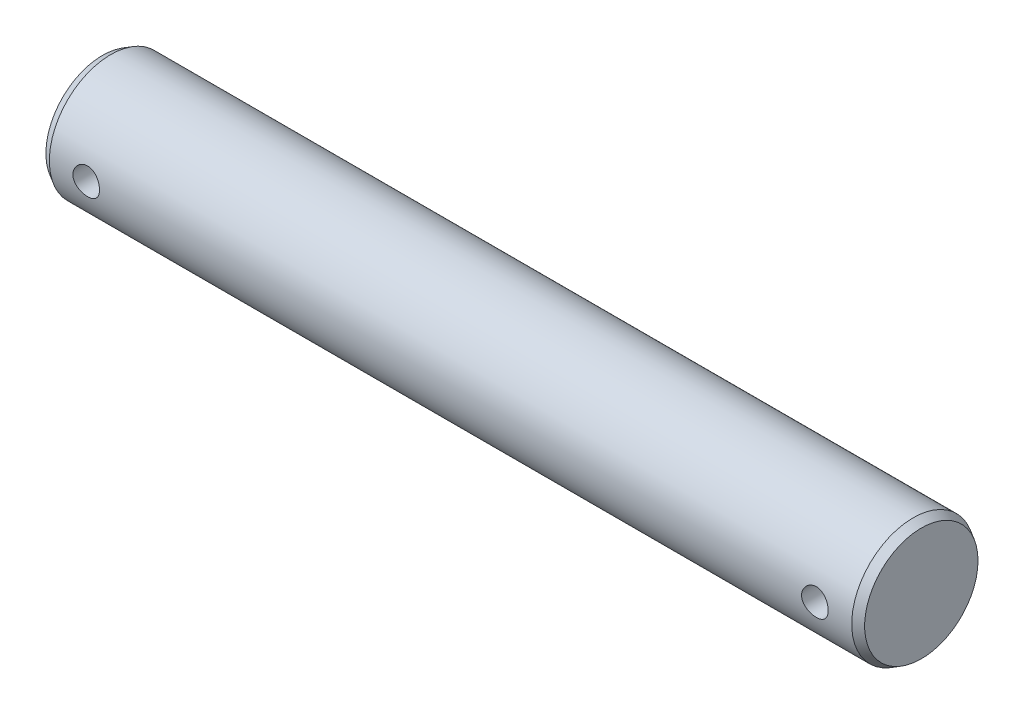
ISO-10303-21;
HEADER;
FILE_DESCRIPTION(('STEP AP214'),'2;1');
FILE_NAME('part.step','',(''),(''),'','','');
FILE_SCHEMA(('AUTOMOTIVE_DESIGN { 1 0 10303 214 1 1 1 1 }'));
ENDSEC;
DATA;
#1=APPLICATION_CONTEXT('core data for automotive mechanical design processes');
#2=APPLICATION_PROTOCOL_DEFINITION('international standard','automotive_design',2000,#1);
#3=PRODUCT_CONTEXT('',#1,'mechanical');
#4=PRODUCT('Part','Part','',(#3));
#5=PRODUCT_RELATED_PRODUCT_CATEGORY('part','',(#4));
#6=PRODUCT_DEFINITION_FORMATION('','',#4);
#7=PRODUCT_DEFINITION_CONTEXT('part definition',#1,'design');
#8=PRODUCT_DEFINITION('design','',#6,#7);
#9=PRODUCT_DEFINITION_SHAPE('','',#8);
#10=(LENGTH_UNIT() NAMED_UNIT(*) SI_UNIT(.MILLI.,.METRE.));
#11=(NAMED_UNIT(*) PLANE_ANGLE_UNIT() SI_UNIT($,.RADIAN.));
#12=(NAMED_UNIT(*) SI_UNIT($,.STERADIAN.) SOLID_ANGLE_UNIT());
#13=UNCERTAINTY_MEASURE_WITH_UNIT(LENGTH_MEASURE(1.E-05),#10,'distance_accuracy_value','');
#14=(GEOMETRIC_REPRESENTATION_CONTEXT(3) GLOBAL_UNCERTAINTY_ASSIGNED_CONTEXT((#13)) GLOBAL_UNIT_ASSIGNED_CONTEXT((#10,
#11,#12)) REPRESENTATION_CONTEXT('',''));
#15=CARTESIAN_POINT('',(0.,0.,0.));
#16=DIRECTION('',(0.,0.,1.));
#17=DIRECTION('',(1.,0.,0.));
#18=AXIS2_PLACEMENT_3D('',#15,#16,#17);
#19=CARTESIAN_POINT('',(200.,0.,0.));
#20=DIRECTION('',(-1.,0.,0.));
#21=DIRECTION('',(0.,0.,1.));
#22=AXIS2_PLACEMENT_3D('',#19,#20,#21);
#23=CYLINDRICAL_SURFACE('',#22,15.);
#24=CARTESIAN_POINT('',(192.25,0.,15.));
#25=CARTESIAN_POINT('',(192.249993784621,-0.180295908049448,14.9999966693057));
#26=CARTESIAN_POINT('',(192.234946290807,-0.360667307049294,14.9967162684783));
#27=CARTESIAN_POINT('',(192.175214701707,-0.716289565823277,14.9839468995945));
#28=CARTESIAN_POINT('',(192.130509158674,-0.891536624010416,14.9744534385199));
#29=CARTESIAN_POINT('',(192.012925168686,-1.23171906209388,14.9503153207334));
#30=CARTESIAN_POINT('',(191.940075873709,-1.39666490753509,14.9356759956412));
#31=CARTESIAN_POINT('',(191.768364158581,-1.71198631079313,14.9028274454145));
#32=CARTESIAN_POINT('',(191.669502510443,-1.8623623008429,14.8846183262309));
#33=CARTESIAN_POINT('',(191.446923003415,-2.14665208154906,14.8463051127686));
#34=CARTESIAN_POINT('',(191.322873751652,-2.28030331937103,14.8261778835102));
#35=CARTESIAN_POINT('',(191.054151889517,-2.52507351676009,14.7864605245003));
#36=CARTESIAN_POINT('',(190.909477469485,-2.63619049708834,14.7668704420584));
#37=CARTESIAN_POINT('',(190.601676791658,-2.83389172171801,14.7302175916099));
#38=CARTESIAN_POINT('',(190.438367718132,-2.92019732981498,14.7131844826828));
#39=CARTESIAN_POINT('',(190.099134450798,-3.06403885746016,14.6839058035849));
#40=CARTESIAN_POINT('',(189.92321173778,-3.12157814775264,14.6716596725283));
#41=CARTESIAN_POINT('',(189.566590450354,-3.20538774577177,14.6535769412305));
#42=CARTESIAN_POINT('',(189.386005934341,-3.23212243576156,14.6476452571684));
#43=CARTESIAN_POINT('',(189.022824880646,-3.25500769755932,14.6425773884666));
#44=CARTESIAN_POINT('',(188.840228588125,-3.25116195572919,14.6434403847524));
#45=CARTESIAN_POINT('',(188.481653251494,-3.21336942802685,14.6517782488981));
#46=CARTESIAN_POINT('',(188.305614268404,-3.17996128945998,14.659134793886));
#47=CARTESIAN_POINT('',(187.961700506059,-3.08484532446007,14.6794438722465));
#48=CARTESIAN_POINT('',(187.793826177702,-3.02313593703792,14.6923967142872));
#49=CARTESIAN_POINT('',(187.469488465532,-2.87267234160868,14.7225560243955));
#50=CARTESIAN_POINT('',(187.313124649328,-2.78371029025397,14.739794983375));
#51=CARTESIAN_POINT('',(187.017344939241,-2.58141287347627,14.7765640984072));
#52=CARTESIAN_POINT('',(186.877931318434,-2.4680742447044,14.7960945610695));
#53=CARTESIAN_POINT('',(186.616907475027,-2.21738589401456,14.835754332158));
#54=CARTESIAN_POINT('',(186.495737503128,-2.07957794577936,14.85588755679));
#55=CARTESIAN_POINT('',(186.278157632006,-1.7853706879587,14.8941069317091));
#56=CARTESIAN_POINT('',(186.181748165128,-1.62897105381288,14.9121930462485));
#57=CARTESIAN_POINT('',(186.016320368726,-1.30148818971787,14.9443373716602));
#58=CARTESIAN_POINT('',(185.947358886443,-1.13037536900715,14.9583872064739));
#59=CARTESIAN_POINT('',(185.839289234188,-0.778618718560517,14.9808135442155));
#60=CARTESIAN_POINT('',(185.800176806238,-0.597976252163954,14.9891908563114));
#61=CARTESIAN_POINT('',(185.753553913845,-0.236065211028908,14.999213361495));
#62=CARTESIAN_POINT('',(185.745441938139,-0.0548775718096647,15.0009866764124));
#63=CARTESIAN_POINT('',(185.759421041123,0.306263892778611,14.9979600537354));
#64=CARTESIAN_POINT('',(185.781510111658,0.486217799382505,14.9931605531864));
#65=CARTESIAN_POINT('',(185.854765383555,0.83779655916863,14.9776083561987));
#66=CARTESIAN_POINT('',(185.905616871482,1.00949009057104,14.9669201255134));
#67=CARTESIAN_POINT('',(186.034604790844,1.34191087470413,14.9407864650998));
#68=CARTESIAN_POINT('',(186.112743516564,1.50263720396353,14.9253406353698));
#69=CARTESIAN_POINT('',(186.295346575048,1.81105407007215,14.8910886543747));
#70=CARTESIAN_POINT('',(186.400165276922,1.95852978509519,14.8722383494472));
#71=CARTESIAN_POINT('',(186.632685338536,2.23401442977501,14.8333599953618));
#72=CARTESIAN_POINT('',(186.760389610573,2.36202087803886,14.8133317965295));
#73=CARTESIAN_POINT('',(187.037813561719,2.59730506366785,14.7739136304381));
#74=CARTESIAN_POINT('',(187.187889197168,2.70416667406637,14.7545417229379));
#75=CARTESIAN_POINT('',(187.504210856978,2.89117048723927,14.7190430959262));
#76=CARTESIAN_POINT('',(187.670456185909,2.97131383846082,14.7029162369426));
#77=CARTESIAN_POINT('',(188.013511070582,3.10207018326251,14.6758857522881));
#78=CARTESIAN_POINT('',(188.190255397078,3.15284800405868,14.6649530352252));
#79=CARTESIAN_POINT('',(188.550034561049,3.22391689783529,14.6494951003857));
#80=CARTESIAN_POINT('',(188.733068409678,3.24421274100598,14.6449688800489));
#81=CARTESIAN_POINT('',(189.096037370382,3.25354151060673,14.6428987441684));
#82=CARTESIAN_POINT('',(189.275955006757,3.24323395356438,14.6452075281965));
#83=CARTESIAN_POINT('',(189.631424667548,3.19312076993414,14.6562145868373));
#84=CARTESIAN_POINT('',(189.806976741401,3.15331547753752,14.6649127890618));
#85=CARTESIAN_POINT('',(190.148219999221,3.04565266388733,14.6876474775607));
#86=CARTESIAN_POINT('',(190.313942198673,2.97788940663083,14.7016660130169));
#87=CARTESIAN_POINT('',(190.631764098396,2.81631583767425,14.7334692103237));
#88=CARTESIAN_POINT('',(190.783862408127,2.72250287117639,14.7512542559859));
#89=CARTESIAN_POINT('',(191.073373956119,2.5092979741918,14.7890277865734));
#90=CARTESIAN_POINT('',(191.210435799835,2.38943530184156,14.809052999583));
#91=CARTESIAN_POINT('',(191.462716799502,2.12848952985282,14.8488018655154));
#92=CARTESIAN_POINT('',(191.577930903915,1.98740153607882,14.8685254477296));
#93=CARTESIAN_POINT('',(191.78464218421,1.68585522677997,14.905745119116));
#94=CARTESIAN_POINT('',(191.875820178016,1.52517402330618,14.9232097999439));
#95=CARTESIAN_POINT('',(192.029730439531,1.19042388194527,14.9536295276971));
#96=CARTESIAN_POINT('',(192.092486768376,1.01636641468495,14.9665883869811));
#97=CARTESIAN_POINT('',(192.176476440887,0.7017578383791,14.9842005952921));
#98=CARTESIAN_POINT('',(192.203995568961,0.56291948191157,14.9900889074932));
#99=CARTESIAN_POINT('',(192.240759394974,0.282736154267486,14.9979898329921));
#100=CARTESIAN_POINT('',(192.250004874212,0.141391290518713,15.0000026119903));
#101=CARTESIAN_POINT('',(192.25,0.,15.));
#102=B_SPLINE_CURVE_WITH_KNOTS('',3,(#24,#25,#26,#27,#28,#29,#30,#31,#32,#33,#34,#35,#36,#37,
#38,#39,#40,#41,#42,#43,#44,#45,#46,#47,#48,#49,#50,#51,#52,#53,#54,#55,#56,#57,#58,#59,#60,#61,
#62,#63,#64,#65,#66,#67,#68,#69,#70,#71,#72,#73,#74,#75,#76,#77,#78,#79,#80,#81,#82,#83,#84,#85,
#86,#87,#88,#89,#90,#91,#92,#93,#94,#95,#96,#97,#98,#99,#100,#101),.UNSPECIFIED.,.T.,.F.,(4,2,2,
2,2,2,2,2,2,2,2,2,2,2,2,2,2,2,2,2,2,2,2,2,2,2,2,2,2,2,2,2,2,2,2,2,2,2,4),(0.,0.54037020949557,
1.08113162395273,1.6213344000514,2.16152114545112,2.70933860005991,3.25720414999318,
3.81100133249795,4.36473360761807,4.91000435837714,5.45520937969,5.99068035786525,
6.5261808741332,7.06587160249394,7.60563462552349,8.15684427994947,8.70806355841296,
9.2604185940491,9.81269482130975,10.3541989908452,10.8956671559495,11.4313222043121,
11.9670223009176,12.5102471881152,13.0535412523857,13.6066475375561,14.1597300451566,
14.7096772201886,15.2595383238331,15.7976362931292,16.3357281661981,16.8720204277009,
17.408367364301,17.9553599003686,18.5024787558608,19.0565335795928,19.6101184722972,
20.0339046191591,20.4576726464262),.UNSPECIFIED.);
#103=CARTESIAN_POINT('',(192.25,0.,15.));
#104=VERTEX_POINT('',#103);
#105=EDGE_CURVE('E35',#104,#104,#102,.T.);
#106=ORIENTED_EDGE('',*,*,#105,.T.);
#107=EDGE_LOOP('',(#106));
#108=FACE_BOUND('',#107,.T.);
#109=CARTESIAN_POINT('',(192.25,0.,-15.));
#110=CARTESIAN_POINT('',(192.249993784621,0.180295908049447,-14.9999966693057));
#111=CARTESIAN_POINT('',(192.234946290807,0.360667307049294,-14.9967162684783));
#112=CARTESIAN_POINT('',(192.175214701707,0.716289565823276,-14.9839468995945));
#113=CARTESIAN_POINT('',(192.130509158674,0.891536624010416,-14.9744534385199));
#114=CARTESIAN_POINT('',(192.012925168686,1.23171906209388,-14.9503153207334));
#115=CARTESIAN_POINT('',(191.940075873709,1.39666490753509,-14.9356759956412));
#116=CARTESIAN_POINT('',(191.768364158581,1.71198631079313,-14.9028274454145));
#117=CARTESIAN_POINT('',(191.669502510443,1.8623623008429,-14.8846183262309));
#118=CARTESIAN_POINT('',(191.446923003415,2.14665208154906,-14.8463051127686));
#119=CARTESIAN_POINT('',(191.322873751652,2.28030331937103,-14.8261778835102));
#120=CARTESIAN_POINT('',(191.054151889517,2.52507351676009,-14.7864605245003));
#121=CARTESIAN_POINT('',(190.909477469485,2.63619049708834,-14.7668704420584));
#122=CARTESIAN_POINT('',(190.601676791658,2.83389172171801,-14.7302175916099));
#123=CARTESIAN_POINT('',(190.438367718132,2.92019732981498,-14.7131844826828));
#124=CARTESIAN_POINT('',(190.099134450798,3.06403885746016,-14.6839058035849));
#125=CARTESIAN_POINT('',(189.92321173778,3.12157814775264,-14.6716596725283));
#126=CARTESIAN_POINT('',(189.566590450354,3.20538774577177,-14.6535769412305));
#127=CARTESIAN_POINT('',(189.386005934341,3.23212243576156,-14.6476452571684));
#128=CARTESIAN_POINT('',(189.022824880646,3.25500769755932,-14.6425773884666));
#129=CARTESIAN_POINT('',(188.840228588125,3.25116195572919,-14.6434403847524));
#130=CARTESIAN_POINT('',(188.481653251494,3.21336942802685,-14.6517782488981));
#131=CARTESIAN_POINT('',(188.305614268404,3.17996128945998,-14.659134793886));
#132=CARTESIAN_POINT('',(187.961700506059,3.08484532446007,-14.6794438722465));
#133=CARTESIAN_POINT('',(187.793826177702,3.02313593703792,-14.6923967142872));
#134=CARTESIAN_POINT('',(187.469488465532,2.87267234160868,-14.7225560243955));
#135=CARTESIAN_POINT('',(187.313124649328,2.78371029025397,-14.739794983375));
#136=CARTESIAN_POINT('',(187.017344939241,2.58141287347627,-14.7765640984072));
#137=CARTESIAN_POINT('',(186.877931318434,2.4680742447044,-14.7960945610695));
#138=CARTESIAN_POINT('',(186.616907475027,2.21738589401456,-14.835754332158));
#139=CARTESIAN_POINT('',(186.495737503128,2.07957794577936,-14.85588755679));
#140=CARTESIAN_POINT('',(186.278157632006,1.7853706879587,-14.8941069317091));
#141=CARTESIAN_POINT('',(186.181748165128,1.62897105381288,-14.9121930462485));
#142=CARTESIAN_POINT('',(186.016320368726,1.30148818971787,-14.9443373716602));
#143=CARTESIAN_POINT('',(185.947358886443,1.13037536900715,-14.9583872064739));
#144=CARTESIAN_POINT('',(185.839289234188,0.778618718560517,-14.9808135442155));
#145=CARTESIAN_POINT('',(185.800176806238,0.597976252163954,-14.9891908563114));
#146=CARTESIAN_POINT('',(185.753553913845,0.236065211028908,-14.999213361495));
#147=CARTESIAN_POINT('',(185.745441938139,0.0548775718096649,-15.0009866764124));
#148=CARTESIAN_POINT('',(185.759421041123,-0.30626389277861,-14.9979600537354));
#149=CARTESIAN_POINT('',(185.781510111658,-0.486217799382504,-14.9931605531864));
#150=CARTESIAN_POINT('',(185.854765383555,-0.837796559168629,-14.9776083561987));
#151=CARTESIAN_POINT('',(185.905616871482,-1.00949009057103,-14.9669201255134));
#152=CARTESIAN_POINT('',(186.034604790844,-1.34191087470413,-14.9407864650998));
#153=CARTESIAN_POINT('',(186.112743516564,-1.50263720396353,-14.9253406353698));
#154=CARTESIAN_POINT('',(186.295346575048,-1.81105407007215,-14.8910886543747));
#155=CARTESIAN_POINT('',(186.400165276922,-1.9585297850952,-14.8722383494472));
#156=CARTESIAN_POINT('',(186.632685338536,-2.23401442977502,-14.8333599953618));
#157=CARTESIAN_POINT('',(186.760389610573,-2.36202087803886,-14.8133317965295));
#158=CARTESIAN_POINT('',(187.037813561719,-2.59730506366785,-14.7739136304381));
#159=CARTESIAN_POINT('',(187.187889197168,-2.70416667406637,-14.7545417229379));
#160=CARTESIAN_POINT('',(187.504210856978,-2.89117048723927,-14.7190430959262));
#161=CARTESIAN_POINT('',(187.670456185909,-2.97131383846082,-14.7029162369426));
#162=CARTESIAN_POINT('',(188.013511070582,-3.10207018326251,-14.6758857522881));
#163=CARTESIAN_POINT('',(188.190255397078,-3.15284800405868,-14.6649530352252));
#164=CARTESIAN_POINT('',(188.550034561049,-3.22391689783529,-14.6494951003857));
#165=CARTESIAN_POINT('',(188.733068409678,-3.24421274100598,-14.6449688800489));
#166=CARTESIAN_POINT('',(189.096037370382,-3.25354151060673,-14.6428987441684));
#167=CARTESIAN_POINT('',(189.275955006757,-3.24323395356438,-14.6452075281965));
#168=CARTESIAN_POINT('',(189.631424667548,-3.19312076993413,-14.6562145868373));
#169=CARTESIAN_POINT('',(189.806976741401,-3.15331547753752,-14.6649127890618));
#170=CARTESIAN_POINT('',(190.148219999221,-3.04565266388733,-14.6876474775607));
#171=CARTESIAN_POINT('',(190.313942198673,-2.97788940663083,-14.7016660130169));
#172=CARTESIAN_POINT('',(190.631764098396,-2.81631583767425,-14.7334692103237));
#173=CARTESIAN_POINT('',(190.783862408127,-2.72250287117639,-14.7512542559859));
#174=CARTESIAN_POINT('',(191.073373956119,-2.5092979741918,-14.7890277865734));
#175=CARTESIAN_POINT('',(191.210435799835,-2.38943530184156,-14.809052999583));
#176=CARTESIAN_POINT('',(191.462716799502,-2.12848952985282,-14.8488018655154));
#177=CARTESIAN_POINT('',(191.577930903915,-1.98740153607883,-14.8685254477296));
#178=CARTESIAN_POINT('',(191.78464218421,-1.68585522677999,-14.905745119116));
#179=CARTESIAN_POINT('',(191.875820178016,-1.5251740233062,-14.9232097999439));
#180=CARTESIAN_POINT('',(192.029730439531,-1.19042388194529,-14.9536295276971));
#181=CARTESIAN_POINT('',(192.092486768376,-1.01636641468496,-14.9665883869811));
#182=CARTESIAN_POINT('',(192.176476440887,-0.701757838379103,-14.9842005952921));
#183=CARTESIAN_POINT('',(192.203995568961,-0.562919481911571,-14.9900889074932));
#184=CARTESIAN_POINT('',(192.240759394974,-0.282736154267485,-14.9979898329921));
#185=CARTESIAN_POINT('',(192.250004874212,-0.141391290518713,-15.0000026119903));
#186=CARTESIAN_POINT('',(192.25,0.,-15.));
#187=B_SPLINE_CURVE_WITH_KNOTS('',3,(#109,#110,#111,#112,#113,#114,#115,#116,#117,#118,#119,
#120,#121,#122,#123,#124,#125,#126,#127,#128,#129,#130,#131,#132,#133,#134,#135,#136,#137,#138,
#139,#140,#141,#142,#143,#144,#145,#146,#147,#148,#149,#150,#151,#152,#153,#154,#155,#156,#157,
#158,#159,#160,#161,#162,#163,#164,#165,#166,#167,#168,#169,#170,#171,#172,#173,#174,#175,#176,
#177,#178,#179,#180,#181,#182,#183,#184,#185,#186),.UNSPECIFIED.,.T.,.F.,(4,2,2,2,2,2,2,2,2,2,2,
2,2,2,2,2,2,2,2,2,2,2,2,2,2,2,2,2,2,2,2,2,2,2,2,2,2,2,4),(0.,0.54037020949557,1.08113162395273,
1.6213344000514,2.16152114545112,2.7093386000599,3.25720414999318,3.81100133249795,
4.36473360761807,4.91000435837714,5.45520937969,5.99068035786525,6.5261808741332,
7.06587160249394,7.60563462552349,8.15684427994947,8.70806355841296,9.2604185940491,
9.81269482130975,10.3541989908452,10.8956671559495,11.4313222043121,11.9670223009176,
12.5102471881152,13.0535412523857,13.6066475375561,14.1597300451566,14.7096772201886,
15.2595383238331,15.7976362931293,16.3357281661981,16.8720204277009,17.408367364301,
17.9553599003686,18.5024787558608,19.0565335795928,19.6101184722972,20.0339046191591,
20.4576726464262),.UNSPECIFIED.);
#188=CARTESIAN_POINT('',(192.25,0.,-15.));
#189=VERTEX_POINT('',#188);
#190=EDGE_CURVE('E91',#189,#189,#187,.T.);
#191=ORIENTED_EDGE('',*,*,#190,.T.);
#192=EDGE_LOOP('',(#191));
#193=FACE_BOUND('',#192,.T.);
#194=CARTESIAN_POINT('',(14.25,0.,15.));
#195=CARTESIAN_POINT('',(14.2499937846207,-0.180295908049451,14.9999966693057));
#196=CARTESIAN_POINT('',(14.234946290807,-0.360667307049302,14.9967162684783));
#197=CARTESIAN_POINT('',(14.1752147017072,-0.716289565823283,14.9839468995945));
#198=CARTESIAN_POINT('',(14.1305091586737,-0.891536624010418,14.9744534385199));
#199=CARTESIAN_POINT('',(14.0129251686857,-1.23171906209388,14.9503153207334));
#200=CARTESIAN_POINT('',(13.9400758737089,-1.39666490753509,14.9356759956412));
#201=CARTESIAN_POINT('',(13.7683641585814,-1.71198631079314,14.9028274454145));
#202=CARTESIAN_POINT('',(13.669502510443,-1.86236230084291,14.8846183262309));
#203=CARTESIAN_POINT('',(13.4469230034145,-2.14665208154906,14.8463051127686));
#204=CARTESIAN_POINT('',(13.3228737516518,-2.28030331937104,14.8261778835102));
#205=CARTESIAN_POINT('',(13.0541518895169,-2.52507351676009,14.7864605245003));
#206=CARTESIAN_POINT('',(12.9094774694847,-2.63619049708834,14.7668704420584));
#207=CARTESIAN_POINT('',(12.6016767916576,-2.83389172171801,14.7302175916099));
#208=CARTESIAN_POINT('',(12.4383677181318,-2.92019732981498,14.7131844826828));
#209=CARTESIAN_POINT('',(12.0991344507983,-3.06403885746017,14.6839058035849));
#210=CARTESIAN_POINT('',(11.9232117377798,-3.12157814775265,14.6716596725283));
#211=CARTESIAN_POINT('',(11.5665904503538,-3.20538774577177,14.6535769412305));
#212=CARTESIAN_POINT('',(11.3860059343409,-3.23212243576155,14.6476452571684));
#213=CARTESIAN_POINT('',(11.0228248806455,-3.25500769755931,14.6425773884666));
#214=CARTESIAN_POINT('',(10.8402285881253,-3.25116195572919,14.6434403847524));
#215=CARTESIAN_POINT('',(10.4816532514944,-3.21336942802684,14.6517782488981));
#216=CARTESIAN_POINT('',(10.3056142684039,-3.17996128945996,14.659134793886));
#217=CARTESIAN_POINT('',(9.96170050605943,-3.08484532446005,14.6794438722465));
#218=CARTESIAN_POINT('',(9.79382617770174,-3.0231359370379,14.6923967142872));
#219=CARTESIAN_POINT('',(9.46948846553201,-2.87267234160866,14.7225560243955));
#220=CARTESIAN_POINT('',(9.31312464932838,-2.78371029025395,14.739794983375));
#221=CARTESIAN_POINT('',(9.01734493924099,-2.58141287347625,14.7765640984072));
#222=CARTESIAN_POINT('',(8.87793131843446,-2.46807424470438,14.7960945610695));
#223=CARTESIAN_POINT('',(8.61690747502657,-2.21738589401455,14.835754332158));
#224=CARTESIAN_POINT('',(8.49573750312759,-2.07957794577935,14.85588755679));
#225=CARTESIAN_POINT('',(8.27815763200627,-1.78537068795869,14.8941069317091));
#226=CARTESIAN_POINT('',(8.181748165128,-1.62897105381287,14.9121930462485));
#227=CARTESIAN_POINT('',(8.01632036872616,-1.30148818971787,14.9443373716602));
#228=CARTESIAN_POINT('',(7.94735888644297,-1.13037536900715,14.9583872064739));
#229=CARTESIAN_POINT('',(7.83928923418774,-0.778618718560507,14.9808135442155));
#230=CARTESIAN_POINT('',(7.80017680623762,-0.59797625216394,14.9891908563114));
#231=CARTESIAN_POINT('',(7.75355391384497,-0.236065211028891,14.999213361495));
#232=CARTESIAN_POINT('',(7.74544193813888,-0.0548775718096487,15.0009866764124));
#233=CARTESIAN_POINT('',(7.75942104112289,0.306263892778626,14.9979600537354));
#234=CARTESIAN_POINT('',(7.78151011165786,0.48621779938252,14.9931605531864));
#235=CARTESIAN_POINT('',(7.85476538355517,0.837796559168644,14.9776083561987));
#236=CARTESIAN_POINT('',(7.90561687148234,1.00949009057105,14.9669201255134));
#237=CARTESIAN_POINT('',(8.03460479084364,1.34191087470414,14.9407864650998));
#238=CARTESIAN_POINT('',(8.11274351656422,1.50263720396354,14.9253406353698));
#239=CARTESIAN_POINT('',(8.29534657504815,1.81105407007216,14.8910886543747));
#240=CARTESIAN_POINT('',(8.40016527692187,1.9585297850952,14.8722383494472));
#241=CARTESIAN_POINT('',(8.63268533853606,2.23401442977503,14.8333599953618));
#242=CARTESIAN_POINT('',(8.76038961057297,2.36202087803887,14.8133317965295));
#243=CARTESIAN_POINT('',(9.03781356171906,2.59730506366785,14.7739136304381));
#244=CARTESIAN_POINT('',(9.1878891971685,2.70416667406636,14.7545417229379));
#245=CARTESIAN_POINT('',(9.5042108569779,2.89117048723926,14.7190430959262));
#246=CARTESIAN_POINT('',(9.67045618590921,2.97131383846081,14.7029162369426));
#247=CARTESIAN_POINT('',(10.0135110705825,3.1020701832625,14.6758857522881));
#248=CARTESIAN_POINT('',(10.1902553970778,3.15284800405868,14.6649530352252));
#249=CARTESIAN_POINT('',(10.5500345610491,3.22391689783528,14.6494951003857));
#250=CARTESIAN_POINT('',(10.7330684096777,3.24421274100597,14.6449688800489));
#251=CARTESIAN_POINT('',(11.0960373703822,3.25354151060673,14.6428987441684));
#252=CARTESIAN_POINT('',(11.2759550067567,3.24323395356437,14.6452075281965));
#253=CARTESIAN_POINT('',(11.631424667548,3.19312076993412,14.6562145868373));
#254=CARTESIAN_POINT('',(11.8069767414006,3.1533154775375,14.6649127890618));
#255=CARTESIAN_POINT('',(12.1482199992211,3.04565266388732,14.6876474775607));
#256=CARTESIAN_POINT('',(12.3139421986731,2.97788940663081,14.7016660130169));
#257=CARTESIAN_POINT('',(12.6317640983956,2.81631583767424,14.7334692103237));
#258=CARTESIAN_POINT('',(12.7838624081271,2.72250287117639,14.7512542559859));
#259=CARTESIAN_POINT('',(13.0733739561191,2.5092979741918,14.7890277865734));
#260=CARTESIAN_POINT('',(13.2104357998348,2.38943530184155,14.809052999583));
#261=CARTESIAN_POINT('',(13.4627167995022,2.12848952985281,14.8488018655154));
#262=CARTESIAN_POINT('',(13.5779309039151,1.98740153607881,14.8685254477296));
#263=CARTESIAN_POINT('',(13.7846421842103,1.68585522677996,14.905745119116));
#264=CARTESIAN_POINT('',(13.8758201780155,1.52517402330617,14.9232097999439));
#265=CARTESIAN_POINT('',(14.029730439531,1.19042388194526,14.9536295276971));
#266=CARTESIAN_POINT('',(14.0924867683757,1.01636641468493,14.9665883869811));
#267=CARTESIAN_POINT('',(14.1764764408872,0.701757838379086,14.9842005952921));
#268=CARTESIAN_POINT('',(14.2039955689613,0.562919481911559,14.9900889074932));
#269=CARTESIAN_POINT('',(14.2407593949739,0.282736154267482,14.9979898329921));
#270=CARTESIAN_POINT('',(14.250004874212,0.141391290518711,15.0000026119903));
#271=CARTESIAN_POINT('',(14.25,0.,15.));
#272=B_SPLINE_CURVE_WITH_KNOTS('',3,(#194,#195,#196,#197,#198,#199,#200,#201,#202,#203,#204,
#205,#206,#207,#208,#209,#210,#211,#212,#213,#214,#215,#216,#217,#218,#219,#220,#221,#222,#223,
#224,#225,#226,#227,#228,#229,#230,#231,#232,#233,#234,#235,#236,#237,#238,#239,#240,#241,#242,
#243,#244,#245,#246,#247,#248,#249,#250,#251,#252,#253,#254,#255,#256,#257,#258,#259,#260,#261,
#262,#263,#264,#265,#266,#267,#268,#269,#270,#271),.UNSPECIFIED.,.T.,.F.,(4,2,2,2,2,2,2,2,2,2,2,
2,2,2,2,2,2,2,2,2,2,2,2,2,2,2,2,2,2,2,2,2,2,2,2,2,2,2,4),(0.,0.540370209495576,1.08113162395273,
1.6213344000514,2.16152114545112,2.70933860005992,3.25720414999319,3.81100133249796,
4.3647336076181,4.91000435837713,5.45520937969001,5.9906803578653,6.52618087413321,
7.06587160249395,7.60563462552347,8.15684427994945,8.70806355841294,9.26041859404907,
9.81269482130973,10.3541989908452,10.8956671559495,11.4313222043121,11.9670223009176,
12.5102471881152,13.0535412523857,13.606647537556,14.1597300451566,14.7096772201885,
15.2595383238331,15.7976362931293,16.3357281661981,16.8720204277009,17.4083673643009,
17.9553599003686,18.5024787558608,19.0565335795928,19.6101184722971,20.033904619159,
20.4576726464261),.UNSPECIFIED.);
#273=CARTESIAN_POINT('',(14.25,0.,15.));
#274=VERTEX_POINT('',#273);
#275=EDGE_CURVE('E58',#274,#274,#272,.T.);
#276=ORIENTED_EDGE('',*,*,#275,.T.);
#277=EDGE_LOOP('',(#276));
#278=FACE_BOUND('',#277,.T.);
#279=CARTESIAN_POINT('',(14.25,0.,-15.));
#280=CARTESIAN_POINT('',(14.2499937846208,0.180295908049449,-14.9999966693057));
#281=CARTESIAN_POINT('',(14.234946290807,0.360667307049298,-14.9967162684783));
#282=CARTESIAN_POINT('',(14.1752147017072,0.716289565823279,-14.9839468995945));
#283=CARTESIAN_POINT('',(14.1305091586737,0.891536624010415,-14.9744534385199));
#284=CARTESIAN_POINT('',(14.0129251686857,1.23171906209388,-14.9503153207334));
#285=CARTESIAN_POINT('',(13.9400758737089,1.39666490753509,-14.9356759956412));
#286=CARTESIAN_POINT('',(13.7683641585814,1.71198631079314,-14.9028274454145));
#287=CARTESIAN_POINT('',(13.669502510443,1.8623623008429,-14.8846183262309));
#288=CARTESIAN_POINT('',(13.4469230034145,2.14665208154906,-14.8463051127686));
#289=CARTESIAN_POINT('',(13.3228737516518,2.28030331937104,-14.8261778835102));
#290=CARTESIAN_POINT('',(13.0541518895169,2.52507351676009,-14.7864605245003));
#291=CARTESIAN_POINT('',(12.9094774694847,2.63619049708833,-14.7668704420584));
#292=CARTESIAN_POINT('',(12.6016767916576,2.83389172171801,-14.7302175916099));
#293=CARTESIAN_POINT('',(12.4383677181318,2.92019732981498,-14.7131844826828));
#294=CARTESIAN_POINT('',(12.0991344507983,3.06403885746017,-14.6839058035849));
#295=CARTESIAN_POINT('',(11.9232117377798,3.12157814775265,-14.6716596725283));
#296=CARTESIAN_POINT('',(11.5665904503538,3.20538774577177,-14.6535769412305));
#297=CARTESIAN_POINT('',(11.3860059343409,3.23212243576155,-14.6476452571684));
#298=CARTESIAN_POINT('',(11.0228248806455,3.25500769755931,-14.6425773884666));
#299=CARTESIAN_POINT('',(10.8402285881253,3.25116195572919,-14.6434403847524));
#300=CARTESIAN_POINT('',(10.4816532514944,3.21336942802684,-14.6517782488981));
#301=CARTESIAN_POINT('',(10.3056142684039,3.17996128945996,-14.659134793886));
#302=CARTESIAN_POINT('',(9.96170050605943,3.08484532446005,-14.6794438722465));
#303=CARTESIAN_POINT('',(9.79382617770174,3.0231359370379,-14.6923967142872));
#304=CARTESIAN_POINT('',(9.46948846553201,2.87267234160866,-14.7225560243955));
#305=CARTESIAN_POINT('',(9.31312464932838,2.78371029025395,-14.739794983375));
#306=CARTESIAN_POINT('',(9.01734493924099,2.58141287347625,-14.7765640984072));
#307=CARTESIAN_POINT('',(8.87793131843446,2.46807424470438,-14.7960945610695));
#308=CARTESIAN_POINT('',(8.61690747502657,2.21738589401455,-14.835754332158));
#309=CARTESIAN_POINT('',(8.49573750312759,2.07957794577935,-14.85588755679));
#310=CARTESIAN_POINT('',(8.27815763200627,1.78537068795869,-14.8941069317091));
#311=CARTESIAN_POINT('',(8.181748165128,1.62897105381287,-14.9121930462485));
#312=CARTESIAN_POINT('',(8.01632036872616,1.30148818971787,-14.9443373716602));
#313=CARTESIAN_POINT('',(7.94735888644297,1.13037536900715,-14.9583872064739));
#314=CARTESIAN_POINT('',(7.83928923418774,0.778618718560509,-14.9808135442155));
#315=CARTESIAN_POINT('',(7.80017680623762,0.597976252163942,-14.9891908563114));
#316=CARTESIAN_POINT('',(7.75355391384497,0.236065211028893,-14.999213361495));
#317=CARTESIAN_POINT('',(7.74544193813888,0.0548775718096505,-15.0009866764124));
#318=CARTESIAN_POINT('',(7.75942104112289,-0.306263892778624,-14.9979600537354));
#319=CARTESIAN_POINT('',(7.78151011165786,-0.486217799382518,-14.9931605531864));
#320=CARTESIAN_POINT('',(7.85476538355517,-0.83779655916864,-14.9776083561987));
#321=CARTESIAN_POINT('',(7.90561687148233,-1.00949009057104,-14.9669201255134));
#322=CARTESIAN_POINT('',(8.03460479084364,-1.34191087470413,-14.9407864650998));
#323=CARTESIAN_POINT('',(8.11274351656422,-1.50263720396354,-14.9253406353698));
#324=CARTESIAN_POINT('',(8.29534657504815,-1.81105407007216,-14.8910886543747));
#325=CARTESIAN_POINT('',(8.40016527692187,-1.9585297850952,-14.8722383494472));
#326=CARTESIAN_POINT('',(8.63268533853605,-2.23401442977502,-14.8333599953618));
#327=CARTESIAN_POINT('',(8.76038961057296,-2.36202087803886,-14.8133317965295));
#328=CARTESIAN_POINT('',(9.03781356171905,-2.59730506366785,-14.7739136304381));
#329=CARTESIAN_POINT('',(9.1878891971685,-2.70416667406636,-14.7545417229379));
#330=CARTESIAN_POINT('',(9.50421085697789,-2.89117048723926,-14.7190430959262));
#331=CARTESIAN_POINT('',(9.6704561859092,-2.97131383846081,-14.7029162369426));
#332=CARTESIAN_POINT('',(10.0135110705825,-3.1020701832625,-14.6758857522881));
#333=CARTESIAN_POINT('',(10.1902553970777,-3.15284800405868,-14.6649530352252));
#334=CARTESIAN_POINT('',(10.5500345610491,-3.22391689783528,-14.6494951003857));
#335=CARTESIAN_POINT('',(10.7330684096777,-3.24421274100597,-14.6449688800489));
#336=CARTESIAN_POINT('',(11.0960373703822,-3.25354151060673,-14.6428987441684));
#337=CARTESIAN_POINT('',(11.2759550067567,-3.24323395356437,-14.6452075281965));
#338=CARTESIAN_POINT('',(11.631424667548,-3.19312076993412,-14.6562145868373));
#339=CARTESIAN_POINT('',(11.8069767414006,-3.1533154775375,-14.6649127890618));
#340=CARTESIAN_POINT('',(12.1482199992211,-3.04565266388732,-14.6876474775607));
#341=CARTESIAN_POINT('',(12.3139421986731,-2.97788940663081,-14.7016660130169));
#342=CARTESIAN_POINT('',(12.6317640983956,-2.81631583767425,-14.7334692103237));
#343=CARTESIAN_POINT('',(12.783862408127,-2.72250287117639,-14.7512542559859));
#344=CARTESIAN_POINT('',(13.0733739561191,-2.5092979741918,-14.7890277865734));
#345=CARTESIAN_POINT('',(13.2104357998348,-2.38943530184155,-14.809052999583));
#346=CARTESIAN_POINT('',(13.4627167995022,-2.12848952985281,-14.8488018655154));
#347=CARTESIAN_POINT('',(13.5779309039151,-1.98740153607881,-14.8685254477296));
#348=CARTESIAN_POINT('',(13.7846421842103,-1.68585522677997,-14.905745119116));
#349=CARTESIAN_POINT('',(13.8758201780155,-1.52517402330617,-14.9232097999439));
#350=CARTESIAN_POINT('',(14.029730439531,-1.19042388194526,-14.9536295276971));
#351=CARTESIAN_POINT('',(14.0924867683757,-1.01636641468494,-14.9665883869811));
#352=CARTESIAN_POINT('',(14.1764764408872,-0.701757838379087,-14.9842005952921));
#353=CARTESIAN_POINT('',(14.2039955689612,-0.562919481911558,-14.9900889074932));
#354=CARTESIAN_POINT('',(14.2407593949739,-0.28273615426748,-14.9979898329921));
#355=CARTESIAN_POINT('',(14.2500048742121,-0.14139129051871,-15.0000026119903));
#356=CARTESIAN_POINT('',(14.25,0.,-15.));
#357=B_SPLINE_CURVE_WITH_KNOTS('',3,(#279,#280,#281,#282,#283,#284,#285,#286,#287,#288,#289,
#290,#291,#292,#293,#294,#295,#296,#297,#298,#299,#300,#301,#302,#303,#304,#305,#306,#307,#308,
#309,#310,#311,#312,#313,#314,#315,#316,#317,#318,#319,#320,#321,#322,#323,#324,#325,#326,#327,
#328,#329,#330,#331,#332,#333,#334,#335,#336,#337,#338,#339,#340,#341,#342,#343,#344,#345,#346,
#347,#348,#349,#350,#351,#352,#353,#354,#355,#356),.UNSPECIFIED.,.T.,.F.,(4,2,2,2,2,2,2,2,2,2,2,
2,2,2,2,2,2,2,2,2,2,2,2,2,2,2,2,2,2,2,2,2,2,2,2,2,2,2,4),(0.,0.540370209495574,1.08113162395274,
1.6213344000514,2.16152114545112,2.70933860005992,3.25720414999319,3.81100133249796,
4.3647336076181,4.91000435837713,5.45520937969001,5.9906803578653,6.52618087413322,
7.06587160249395,7.60563462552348,8.15684427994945,8.70806355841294,9.26041859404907,
9.81269482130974,10.3541989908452,10.8956671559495,11.4313222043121,11.9670223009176,
12.5102471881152,13.0535412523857,13.606647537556,14.1597300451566,14.7096772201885,
15.2595383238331,15.7976362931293,16.3357281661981,16.8720204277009,17.4083673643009,
17.9553599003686,18.5024787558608,19.0565335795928,19.6101184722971,20.033904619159,
20.4576726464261),.UNSPECIFIED.);
#358=CARTESIAN_POINT('',(14.25,0.,-15.));
#359=VERTEX_POINT('',#358);
#360=EDGE_CURVE('E52',#359,#359,#357,.T.);
#361=ORIENTED_EDGE('',*,*,#360,.T.);
#362=EDGE_LOOP('',(#361));
#363=FACE_BOUND('',#362,.T.);
#364=CARTESIAN_POINT('',(198.,0.,0.));
#365=DIRECTION('',(1.,0.,0.));
#366=DIRECTION('',(0.,0.,-1.));
#367=AXIS2_PLACEMENT_3D('',#364,#365,#366);
#368=CIRCLE('',#367,15.);
#369=CARTESIAN_POINT('',(198.,0.,-15.));
#370=VERTEX_POINT('',#369);
#371=EDGE_CURVE('E43',#370,#370,#368,.F.);
#372=ORIENTED_EDGE('',*,*,#371,.T.);
#373=EDGE_LOOP('',(#372));
#374=FACE_BOUND('',#373,.T.);
#375=CARTESIAN_POINT('',(2.,0.,0.));
#376=DIRECTION('',(1.,0.,0.));
#377=DIRECTION('',(0.,0.,-1.));
#378=AXIS2_PLACEMENT_3D('',#375,#376,#377);
#379=CIRCLE('',#378,15.);
#380=CARTESIAN_POINT('',(2.,0.,-15.));
#381=VERTEX_POINT('',#380);
#382=EDGE_CURVE('E48',#381,#381,#379,.T.);
#383=ORIENTED_EDGE('',*,*,#382,.T.);
#384=EDGE_LOOP('',(#383));
#385=FACE_BOUND('',#384,.T.);
#386=ADVANCED_FACE('F31',(#108,#193,#278,#363,#374,#385),#23,.T.);
#387=CARTESIAN_POINT('',(200.,0.,0.));
#388=DIRECTION('',(1.,0.,0.));
#389=DIRECTION('',(0.,0.,-1.));
#390=AXIS2_PLACEMENT_3D('',#387,#388,#389);
#391=PLANE('',#390);
#392=CARTESIAN_POINT('',(200.,0.,0.));
#393=DIRECTION('',(1.,0.,0.));
#394=DIRECTION('',(0.,0.,-1.));
#395=AXIS2_PLACEMENT_3D('',#392,#393,#394);
#396=CIRCLE('',#395,13.8452994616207);
#397=CARTESIAN_POINT('',(200.,0.,-13.8452994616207));
#398=VERTEX_POINT('',#397);
#399=EDGE_CURVE('E102',#398,#398,#396,.T.);
#400=ORIENTED_EDGE('',*,*,#399,.T.);
#401=EDGE_LOOP('',(#400));
#402=FACE_BOUND('',#401,.T.);
#403=ADVANCED_FACE('F70',(#402),#391,.T.);
#404=CARTESIAN_POINT('',(0.,0.,0.));
#405=DIRECTION('',(1.,0.,0.));
#406=DIRECTION('',(0.,0.,-1.));
#407=AXIS2_PLACEMENT_3D('',#404,#405,#406);
#408=PLANE('',#407);
#409=CARTESIAN_POINT('',(0.,0.,0.));
#410=DIRECTION('',(1.,0.,0.));
#411=DIRECTION('',(0.,0.,-1.));
#412=AXIS2_PLACEMENT_3D('',#409,#410,#411);
#413=CIRCLE('',#412,13.8452994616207);
#414=CARTESIAN_POINT('',(0.,0.,-13.8452994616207));
#415=VERTEX_POINT('',#414);
#416=EDGE_CURVE('E10',#415,#415,#413,.F.);
#417=ORIENTED_EDGE('',*,*,#416,.T.);
#418=EDGE_LOOP('',(#417));
#419=FACE_BOUND('',#418,.T.);
#420=ADVANCED_FACE('F73',(#419),#408,.F.);
#421=CARTESIAN_POINT('',(200.,0.,0.));
#422=DIRECTION('',(-1.,0.,0.));
#423=DIRECTION('',(0.,0.,1.));
#424=AXIS2_PLACEMENT_3D('',#421,#422,#423);
#425=CONICAL_SURFACE('',#424,13.8452994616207,0.523598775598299);
#426=ORIENTED_EDGE('',*,*,#371,.F.);
#427=EDGE_LOOP('',(#426));
#428=FACE_BOUND('',#427,.T.);
#429=ORIENTED_EDGE('',*,*,#399,.F.);
#430=EDGE_LOOP('',(#429));
#431=FACE_BOUND('',#430,.T.);
#432=ADVANCED_FACE('F76',(#428,#431),#425,.T.);
#433=CARTESIAN_POINT('',(2.,0.,0.));
#434=DIRECTION('',(1.,0.,0.));
#435=DIRECTION('',(0.,0.,-1.));
#436=AXIS2_PLACEMENT_3D('',#433,#434,#435);
#437=CONICAL_SURFACE('',#436,15.,0.523598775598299);
#438=ORIENTED_EDGE('',*,*,#416,.F.);
#439=EDGE_LOOP('',(#438));
#440=FACE_BOUND('',#439,.T.);
#441=ORIENTED_EDGE('',*,*,#382,.F.);
#442=EDGE_LOOP('',(#441));
#443=FACE_BOUND('',#442,.T.);
#444=ADVANCED_FACE('F33',(#440,#443),#437,.T.);
#445=CARTESIAN_POINT('',(11.,0.,-23.9999999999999));
#446=DIRECTION('',(0.,0.,1.));
#447=DIRECTION('',(1.,0.,0.));
#448=AXIS2_PLACEMENT_3D('',#445,#446,#447);
#449=CYLINDRICAL_SURFACE('',#448,3.25);
#450=ORIENTED_EDGE('',*,*,#360,.F.);
#451=EDGE_LOOP('',(#450));
#452=FACE_BOUND('',#451,.T.);
#453=ORIENTED_EDGE('',*,*,#275,.F.);
#454=EDGE_LOOP('',(#453));
#455=FACE_BOUND('',#454,.T.);
#456=ADVANCED_FACE('F63',(#452,#455),#449,.F.);
#457=CARTESIAN_POINT('',(189.,0.,-23.9999999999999));
#458=DIRECTION('',(0.,0.,1.));
#459=DIRECTION('',(1.,0.,0.));
#460=AXIS2_PLACEMENT_3D('',#457,#458,#459);
#461=CYLINDRICAL_SURFACE('',#460,3.25000000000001);
#462=ORIENTED_EDGE('',*,*,#190,.F.);
#463=EDGE_LOOP('',(#462));
#464=FACE_BOUND('',#463,.T.);
#465=ORIENTED_EDGE('',*,*,#105,.F.);
#466=EDGE_LOOP('',(#465));
#467=FACE_BOUND('',#466,.T.);
#468=ADVANCED_FACE('F67',(#464,#467),#461,.F.);
#469=CLOSED_SHELL('',(#386,#403,#420,#432,#444,#456,#468));
#470=MANIFOLD_SOLID_BREP('B2',#469);
#471=ADVANCED_BREP_SHAPE_REPRESENTATION('',(#18,#470),#14);
#472=SHAPE_DEFINITION_REPRESENTATION(#9,#471);
ENDSEC;
END-ISO-10303-21;
